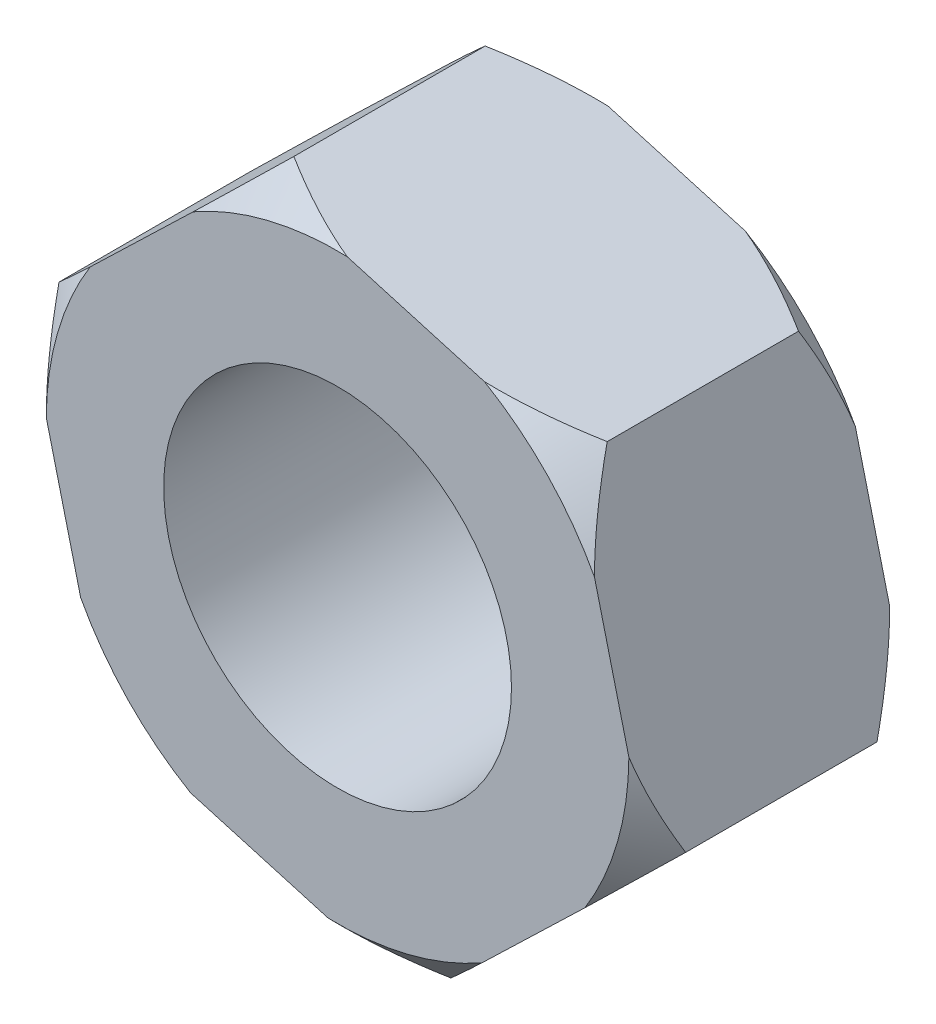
from build123d import *

# Parameters (mm, degrees)
SKETCH_1_R          = 7.5
SKETCH_1_R_2        = 4
EXTRUDE_320_DEPTH   = 6
CHAMFER_1_SIZE      = 0.8
CHAMFER_2_SIZE      = 0.8
SKETCH_2_R          = 11.405516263
CUT_EXTRUDE_1_DEPTH = 13.186057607


with BuildPart() as part:
    # Sketch 1 → Extrude 320 (new body)
    with BuildSketch(Plane.XY):
        Circle(SKETCH_1_R)
        Circle(SKETCH_1_R_2, mode=Mode.SUBTRACT)
    extrude(amount=EXTRUDE_320_DEPTH)

    # Chamfer 1
    chamfer_1_edges = [part.edges().sort_by_distance(p)[0] for p in [
        (-7.5, 0, 6),
    ]]
    chamfer(chamfer_1_edges, length=CHAMFER_1_SIZE)

    # Chamfer 2
    chamfer_2_edges = [part.edges().sort_by_distance(p)[0] for p in [
        (-7.5, 0, 0),
    ]]
    chamfer(chamfer_2_edges, length=CHAMFER_2_SIZE)

    # Sketch 2 → Cut-Extrude 1 (cut, through all)
    with BuildSketch(Plane.XY.offset(6)):
        Circle(SKETCH_2_R)
        Polygon((5.401801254, 5.202936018), (-1.804974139, 7.279565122), (-7.206775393, 2.076629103), (-5.401801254, -5.202936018), (1.804974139, -7.279565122), (7.206775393, -2.076629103), align=None, mode=Mode.SUBTRACT)
    extrude(amount=-CUT_EXTRUDE_1_DEPTH, mode=Mode.SUBTRACT)


solid = part.part
